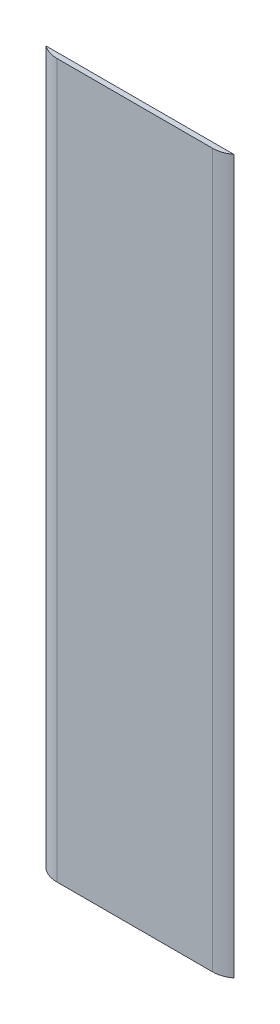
ISO-10303-21;
HEADER;
FILE_DESCRIPTION(('STEP AP214'),'2;1');
FILE_NAME('part.step','',(''),(''),'','','');
FILE_SCHEMA(('AUTOMOTIVE_DESIGN { 1 0 10303 214 1 1 1 1 }'));
ENDSEC;
DATA;
#1=APPLICATION_CONTEXT('core data for automotive mechanical design processes');
#2=APPLICATION_PROTOCOL_DEFINITION('international standard','automotive_design',2000,#1);
#3=PRODUCT_CONTEXT('',#1,'mechanical');
#4=PRODUCT('Part','Part','',(#3));
#5=PRODUCT_RELATED_PRODUCT_CATEGORY('part','',(#4));
#6=PRODUCT_DEFINITION_FORMATION('','',#4);
#7=PRODUCT_DEFINITION_CONTEXT('part definition',#1,'design');
#8=PRODUCT_DEFINITION('design','',#6,#7);
#9=PRODUCT_DEFINITION_SHAPE('','',#8);
#10=(LENGTH_UNIT() NAMED_UNIT(*) SI_UNIT(.MILLI.,.METRE.));
#11=(NAMED_UNIT(*) PLANE_ANGLE_UNIT() SI_UNIT($,.RADIAN.));
#12=(NAMED_UNIT(*) SI_UNIT($,.STERADIAN.) SOLID_ANGLE_UNIT());
#13=UNCERTAINTY_MEASURE_WITH_UNIT(LENGTH_MEASURE(1.E-05),#10,'distance_accuracy_value','');
#14=(GEOMETRIC_REPRESENTATION_CONTEXT(3) GLOBAL_UNCERTAINTY_ASSIGNED_CONTEXT((#13)) GLOBAL_UNIT_ASSIGNED_CONTEXT((#10,
#11,#12)) REPRESENTATION_CONTEXT('',''));
#15=CARTESIAN_POINT('',(0.,0.,0.));
#16=DIRECTION('',(0.,0.,1.));
#17=DIRECTION('',(1.,0.,0.));
#18=AXIS2_PLACEMENT_3D('',#15,#16,#17);
#19=CARTESIAN_POINT('',(0.,0.,0.));
#20=DIRECTION('',(0.,0.,-1.));
#21=DIRECTION('',(-1.,0.,0.));
#22=AXIS2_PLACEMENT_3D('',#19,#20,#21);
#23=PLANE('',#22);
#24=DIRECTION('',(0.,1.,0.));
#25=VECTOR('',#24,1.);
#26=CARTESIAN_POINT('',(17.5,-66.5,0.));
#27=LINE('',#26,#25);
#28=CARTESIAN_POINT('',(17.5,-66.5,0.));
#29=VERTEX_POINT('',#28);
#30=CARTESIAN_POINT('',(17.5,66.5,0.));
#31=VERTEX_POINT('',#30);
#32=EDGE_CURVE('E150',#29,#31,#27,.T.);
#33=ORIENTED_EDGE('',*,*,#32,.F.);
#34=DIRECTION('',(1.,0.,0.));
#35=VECTOR('',#34,1.);
#36=CARTESIAN_POINT('',(-17.5,-66.5,0.));
#37=LINE('',#36,#35);
#38=CARTESIAN_POINT('',(-17.5,-66.5,0.));
#39=VERTEX_POINT('',#38);
#40=EDGE_CURVE('E163',#39,#29,#37,.T.);
#41=ORIENTED_EDGE('',*,*,#40,.F.);
#42=DIRECTION('',(0.,-1.,0.));
#43=VECTOR('',#42,1.);
#44=CARTESIAN_POINT('',(-17.5,-66.5,0.));
#45=LINE('',#44,#43);
#46=CARTESIAN_POINT('',(-17.5,66.5,0.));
#47=VERTEX_POINT('',#46);
#48=EDGE_CURVE('E167',#47,#39,#45,.T.);
#49=ORIENTED_EDGE('',*,*,#48,.F.);
#50=DIRECTION('',(-1.,0.,0.));
#51=VECTOR('',#50,1.);
#52=CARTESIAN_POINT('',(-17.5,66.5,0.));
#53=LINE('',#52,#51);
#54=EDGE_CURVE('E153',#31,#47,#53,.T.);
#55=ORIENTED_EDGE('',*,*,#54,.F.);
#56=EDGE_LOOP('',(#33,#41,#49,#55));
#57=FACE_BOUND('',#56,.T.);
#58=DIRECTION('',(-1.,0.,0.));
#59=VECTOR('',#58,1.);
#60=CARTESIAN_POINT('',(15.,-26.,0.));
#61=LINE('',#60,#59);
#62=CARTESIAN_POINT('',(15.,-26.,0.));
#63=VERTEX_POINT('',#62);
#64=CARTESIAN_POINT('',(14.,-26.,0.));
#65=VERTEX_POINT('',#64);
#66=EDGE_CURVE('E353',#63,#65,#61,.T.);
#67=ORIENTED_EDGE('',*,*,#66,.F.);
#68=DIRECTION('',(0.,-1.,0.));
#69=VECTOR('',#68,1.);
#70=CARTESIAN_POINT('',(15.,64.,0.));
#71=LINE('',#70,#69);
#72=CARTESIAN_POINT('',(15.,64.,0.));
#73=VERTEX_POINT('',#72);
#74=EDGE_CURVE('E148',#73,#63,#71,.T.);
#75=ORIENTED_EDGE('',*,*,#74,.F.);
#76=DIRECTION('',(1.,0.,0.));
#77=VECTOR('',#76,1.);
#78=CARTESIAN_POINT('',(15.,64.,0.));
#79=LINE('',#78,#77);
#80=CARTESIAN_POINT('',(-15.,64.,0.));
#81=VERTEX_POINT('',#80);
#82=EDGE_CURVE('E144',#81,#73,#79,.T.);
#83=ORIENTED_EDGE('',*,*,#82,.F.);
#84=DIRECTION('',(0.,1.,0.));
#85=VECTOR('',#84,1.);
#86=CARTESIAN_POINT('',(-15.,64.,0.));
#87=LINE('',#86,#85);
#88=CARTESIAN_POINT('',(-15.,-26.,0.));
#89=VERTEX_POINT('',#88);
#90=EDGE_CURVE('E349',#89,#81,#87,.T.);
#91=ORIENTED_EDGE('',*,*,#90,.F.);
#92=DIRECTION('',(-1.,0.,0.));
#93=VECTOR('',#92,1.);
#94=CARTESIAN_POINT('',(-14.,-26.,0.));
#95=LINE('',#94,#93);
#96=CARTESIAN_POINT('',(-14.,-26.,0.));
#97=VERTEX_POINT('',#96);
#98=EDGE_CURVE('E365',#97,#89,#95,.T.);
#99=ORIENTED_EDGE('',*,*,#98,.F.);
#100=DIRECTION('',(0.,-1.,0.));
#101=VECTOR('',#100,1.);
#102=CARTESIAN_POINT('',(-14.,-25.,0.));
#103=LINE('',#102,#101);
#104=CARTESIAN_POINT('',(-14.,63.,0.));
#105=VERTEX_POINT('',#104);
#106=EDGE_CURVE('E363',#105,#97,#103,.T.);
#107=ORIENTED_EDGE('',*,*,#106,.F.);
#108=DIRECTION('',(-1.,0.,0.));
#109=VECTOR('',#108,1.);
#110=CARTESIAN_POINT('',(14.,63.,0.));
#111=LINE('',#110,#109);
#112=CARTESIAN_POINT('',(14.,63.,0.));
#113=VERTEX_POINT('',#112);
#114=EDGE_CURVE('E361',#113,#105,#111,.T.);
#115=ORIENTED_EDGE('',*,*,#114,.F.);
#116=DIRECTION('',(0.,1.,0.));
#117=VECTOR('',#116,1.);
#118=CARTESIAN_POINT('',(14.,63.,0.));
#119=LINE('',#118,#117);
#120=EDGE_CURVE('E355',#65,#113,#119,.T.);
#121=ORIENTED_EDGE('',*,*,#120,.F.);
#122=EDGE_LOOP('',(#67,#75,#83,#91,#99,#107,#115,#121));
#123=FACE_BOUND('',#122,.T.);
#124=ADVANCED_FACE('F36',(#57,#123),#23,.T.);
#125=CARTESIAN_POINT('',(-17.5,66.5,1.));
#126=DIRECTION('',(0.,-1.,0.));
#127=DIRECTION('',(0.,0.,-1.));
#128=AXIS2_PLACEMENT_3D('',#125,#126,#127);
#129=PLANE('',#128);
#130=ORIENTED_EDGE('',*,*,#54,.T.);
#131=CARTESIAN_POINT('',(-14.5,66.5,-4.));
#132=DIRECTION('',(0.,-1.,0.));
#133=DIRECTION('',(0.,0.,-1.));
#134=AXIS2_PLACEMENT_3D('',#131,#132,#133);
#135=CIRCLE('',#134,5.);
#136=CARTESIAN_POINT('',(-14.5,66.5,1.));
#137=VERTEX_POINT('',#136);
#138=EDGE_CURVE('E11',#47,#137,#135,.F.);
#139=ORIENTED_EDGE('',*,*,#138,.T.);
#140=DIRECTION('',(-1.,0.,0.));
#141=VECTOR('',#140,1.);
#142=CARTESIAN_POINT('',(-17.5,66.5,1.));
#143=LINE('',#142,#141);
#144=CARTESIAN_POINT('',(14.5,66.5,1.));
#145=VERTEX_POINT('',#144);
#146=EDGE_CURVE('E159',#145,#137,#143,.T.);
#147=ORIENTED_EDGE('',*,*,#146,.F.);
#148=CARTESIAN_POINT('',(14.5,66.5,-4.));
#149=DIRECTION('',(0.,-1.,0.));
#150=DIRECTION('',(0.,0.,-1.));
#151=AXIS2_PLACEMENT_3D('',#148,#149,#150);
#152=CIRCLE('',#151,5.);
#153=EDGE_CURVE('E44',#145,#31,#152,.F.);
#154=ORIENTED_EDGE('',*,*,#153,.T.);
#155=EDGE_LOOP('',(#130,#139,#147,#154));
#156=FACE_BOUND('',#155,.T.);
#157=ADVANCED_FACE('F181',(#156),#129,.F.);
#158=CARTESIAN_POINT('',(-17.5,-66.5,1.));
#159=DIRECTION('',(0.,1.,0.));
#160=DIRECTION('',(0.,0.,1.));
#161=AXIS2_PLACEMENT_3D('',#158,#159,#160);
#162=PLANE('',#161);
#163=DIRECTION('',(1.,0.,0.));
#164=VECTOR('',#163,1.);
#165=CARTESIAN_POINT('',(-17.5,-66.5,1.));
#166=LINE('',#165,#164);
#167=CARTESIAN_POINT('',(-14.5,-66.5,1.));
#168=VERTEX_POINT('',#167);
#169=CARTESIAN_POINT('',(14.5,-66.5,1.));
#170=VERTEX_POINT('',#169);
#171=EDGE_CURVE('E162',#168,#170,#166,.T.);
#172=ORIENTED_EDGE('',*,*,#171,.F.);
#173=CARTESIAN_POINT('',(-14.5,-66.5,-4.));
#174=DIRECTION('',(0.,1.,0.));
#175=DIRECTION('',(0.,0.,1.));
#176=AXIS2_PLACEMENT_3D('',#173,#174,#175);
#177=CIRCLE('',#176,5.);
#178=EDGE_CURVE('E177',#168,#39,#177,.F.);
#179=ORIENTED_EDGE('',*,*,#178,.T.);
#180=ORIENTED_EDGE('',*,*,#40,.T.);
#181=CARTESIAN_POINT('',(14.5,-66.5,-4.));
#182=DIRECTION('',(0.,1.,0.));
#183=DIRECTION('',(0.,0.,1.));
#184=AXIS2_PLACEMENT_3D('',#181,#182,#183);
#185=CIRCLE('',#184,5.);
#186=EDGE_CURVE('E59',#29,#170,#185,.F.);
#187=ORIENTED_EDGE('',*,*,#186,.T.);
#188=EDGE_LOOP('',(#172,#179,#180,#187));
#189=FACE_BOUND('',#188,.T.);
#190=ADVANCED_FACE('F193',(#189),#162,.F.);
#191=CARTESIAN_POINT('',(0.,0.,1.));
#192=DIRECTION('',(0.,0.,-1.));
#193=DIRECTION('',(-1.,0.,0.));
#194=AXIS2_PLACEMENT_3D('',#191,#192,#193);
#195=PLANE('',#194);
#196=ORIENTED_EDGE('',*,*,#146,.T.);
#197=DIRECTION('',(0.,1.,0.));
#198=VECTOR('',#197,1.);
#199=CARTESIAN_POINT('',(-14.5,0.,1.));
#200=LINE('',#199,#198);
#201=EDGE_CURVE('E173',#137,#168,#200,.F.);
#202=ORIENTED_EDGE('',*,*,#201,.T.);
#203=ORIENTED_EDGE('',*,*,#171,.T.);
#204=DIRECTION('',(0.,-1.,0.));
#205=VECTOR('',#204,1.);
#206=CARTESIAN_POINT('',(14.5,0.,1.));
#207=LINE('',#206,#205);
#208=EDGE_CURVE('E164',#170,#145,#207,.F.);
#209=ORIENTED_EDGE('',*,*,#208,.T.);
#210=EDGE_LOOP('',(#196,#202,#203,#209));
#211=FACE_BOUND('',#210,.T.);
#212=ADVANCED_FACE('F191',(#211),#195,.F.);
#213=CARTESIAN_POINT('',(-14.5,-66.5,-4.));
#214=DIRECTION('',(0.,1.,0.));
#215=DIRECTION('',(0.,0.,1.));
#216=AXIS2_PLACEMENT_3D('',#213,#214,#215);
#217=CYLINDRICAL_SURFACE('',#216,5.);
#218=ORIENTED_EDGE('',*,*,#138,.F.);
#219=ORIENTED_EDGE('',*,*,#48,.T.);
#220=ORIENTED_EDGE('',*,*,#178,.F.);
#221=ORIENTED_EDGE('',*,*,#201,.F.);
#222=EDGE_LOOP('',(#218,#219,#220,#221));
#223=FACE_BOUND('',#222,.T.);
#224=ADVANCED_FACE('F195',(#223),#217,.T.);
#225=CARTESIAN_POINT('',(14.5,-66.5,-4.));
#226=DIRECTION('',(0.,-1.,0.));
#227=DIRECTION('',(0.,0.,-1.));
#228=AXIS2_PLACEMENT_3D('',#225,#226,#227);
#229=CYLINDRICAL_SURFACE('',#228,5.);
#230=ORIENTED_EDGE('',*,*,#186,.F.);
#231=ORIENTED_EDGE('',*,*,#32,.T.);
#232=ORIENTED_EDGE('',*,*,#153,.F.);
#233=ORIENTED_EDGE('',*,*,#208,.F.);
#234=EDGE_LOOP('',(#230,#231,#232,#233));
#235=FACE_BOUND('',#234,.T.);
#236=ADVANCED_FACE('F38',(#235),#229,.T.);
#237=CARTESIAN_POINT('',(15.,64.,-2.));
#238=DIRECTION('',(-1.,0.,0.));
#239=DIRECTION('',(0.,-1.,0.));
#240=AXIS2_PLACEMENT_3D('',#237,#238,#239);
#241=PLANE('',#240);
#242=ORIENTED_EDGE('',*,*,#74,.T.);
#243=DIRECTION('',(0.,0.,1.));
#244=VECTOR('',#243,1.);
#245=CARTESIAN_POINT('',(15.,-26.,-2.));
#246=LINE('',#245,#244);
#247=CARTESIAN_POINT('',(15.,-26.,-2.));
#248=VERTEX_POINT('',#247);
#249=EDGE_CURVE('E129',#248,#63,#246,.T.);
#250=ORIENTED_EDGE('',*,*,#249,.F.);
#251=DIRECTION('',(0.,-1.,0.));
#252=VECTOR('',#251,1.);
#253=CARTESIAN_POINT('',(15.,64.,-2.));
#254=LINE('',#253,#252);
#255=CARTESIAN_POINT('',(15.,64.,-2.));
#256=VERTEX_POINT('',#255);
#257=EDGE_CURVE('E136',#256,#248,#254,.T.);
#258=ORIENTED_EDGE('',*,*,#257,.F.);
#259=DIRECTION('',(0.,0.,1.));
#260=VECTOR('',#259,1.);
#261=CARTESIAN_POINT('',(15.,64.,-2.));
#262=LINE('',#261,#260);
#263=EDGE_CURVE('E347',#256,#73,#262,.T.);
#264=ORIENTED_EDGE('',*,*,#263,.T.);
#265=EDGE_LOOP('',(#242,#250,#258,#264));
#266=FACE_BOUND('',#265,.T.);
#267=ADVANCED_FACE('F146',(#266),#241,.F.);
#268=CARTESIAN_POINT('',(15.,-26.,-2.));
#269=DIRECTION('',(0.,1.,0.));
#270=DIRECTION('',(0.,0.,1.));
#271=AXIS2_PLACEMENT_3D('',#268,#269,#270);
#272=PLANE('',#271);
#273=ORIENTED_EDGE('',*,*,#66,.T.);
#274=DIRECTION('',(0.,0.,1.));
#275=VECTOR('',#274,1.);
#276=CARTESIAN_POINT('',(14.,-26.,-2.));
#277=LINE('',#276,#275);
#278=CARTESIAN_POINT('',(14.,-26.,-2.));
#279=VERTEX_POINT('',#278);
#280=EDGE_CURVE('E132',#279,#65,#277,.T.);
#281=ORIENTED_EDGE('',*,*,#280,.F.);
#282=DIRECTION('',(-1.,0.,0.));
#283=VECTOR('',#282,1.);
#284=CARTESIAN_POINT('',(15.,-26.,-2.));
#285=LINE('',#284,#283);
#286=EDGE_CURVE('E125',#248,#279,#285,.T.);
#287=ORIENTED_EDGE('',*,*,#286,.F.);
#288=ORIENTED_EDGE('',*,*,#249,.T.);
#289=EDGE_LOOP('',(#273,#281,#287,#288));
#290=FACE_BOUND('',#289,.T.);
#291=ADVANCED_FACE('F127',(#290),#272,.F.);
#292=CARTESIAN_POINT('',(14.,63.,-2.));
#293=DIRECTION('',(1.,0.,0.));
#294=DIRECTION('',(0.,0.,-1.));
#295=AXIS2_PLACEMENT_3D('',#292,#293,#294);
#296=PLANE('',#295);
#297=ORIENTED_EDGE('',*,*,#120,.T.);
#298=DIRECTION('',(0.,0.,1.));
#299=VECTOR('',#298,1.);
#300=CARTESIAN_POINT('',(14.,63.,-2.));
#301=LINE('',#300,#299);
#302=CARTESIAN_POINT('',(14.,63.,-2.));
#303=VERTEX_POINT('',#302);
#304=EDGE_CURVE('E155',#303,#113,#301,.T.);
#305=ORIENTED_EDGE('',*,*,#304,.F.);
#306=DIRECTION('',(0.,1.,0.));
#307=VECTOR('',#306,1.);
#308=CARTESIAN_POINT('',(14.,-25.,-2.));
#309=LINE('',#308,#307);
#310=EDGE_CURVE('E135',#279,#303,#309,.T.);
#311=ORIENTED_EDGE('',*,*,#310,.F.);
#312=ORIENTED_EDGE('',*,*,#280,.T.);
#313=EDGE_LOOP('',(#297,#305,#311,#312));
#314=FACE_BOUND('',#313,.T.);
#315=ADVANCED_FACE('F253',(#314),#296,.F.);
#316=CARTESIAN_POINT('',(14.,63.,-2.));
#317=DIRECTION('',(0.,1.,0.));
#318=DIRECTION('',(0.,0.,1.));
#319=AXIS2_PLACEMENT_3D('',#316,#317,#318);
#320=PLANE('',#319);
#321=ORIENTED_EDGE('',*,*,#114,.T.);
#322=DIRECTION('',(0.,0.,1.));
#323=VECTOR('',#322,1.);
#324=CARTESIAN_POINT('',(-14.,63.,-2.));
#325=LINE('',#324,#323);
#326=CARTESIAN_POINT('',(-14.,63.,-2.));
#327=VERTEX_POINT('',#326);
#328=EDGE_CURVE('E375',#327,#105,#325,.T.);
#329=ORIENTED_EDGE('',*,*,#328,.F.);
#330=DIRECTION('',(-1.,0.,0.));
#331=VECTOR('',#330,1.);
#332=CARTESIAN_POINT('',(14.,63.,-2.));
#333=LINE('',#332,#331);
#334=EDGE_CURVE('E382',#303,#327,#333,.T.);
#335=ORIENTED_EDGE('',*,*,#334,.F.);
#336=ORIENTED_EDGE('',*,*,#304,.T.);
#337=EDGE_LOOP('',(#321,#329,#335,#336));
#338=FACE_BOUND('',#337,.T.);
#339=ADVANCED_FACE('F264',(#338),#320,.F.);
#340=CARTESIAN_POINT('',(-14.,-25.,-2.));
#341=DIRECTION('',(-1.,0.,0.));
#342=DIRECTION('',(0.,0.,1.));
#343=AXIS2_PLACEMENT_3D('',#340,#341,#342);
#344=PLANE('',#343);
#345=ORIENTED_EDGE('',*,*,#106,.T.);
#346=DIRECTION('',(0.,0.,1.));
#347=VECTOR('',#346,1.);
#348=CARTESIAN_POINT('',(-14.,-26.,-2.));
#349=LINE('',#348,#347);
#350=CARTESIAN_POINT('',(-14.,-26.,-2.));
#351=VERTEX_POINT('',#350);
#352=EDGE_CURVE('E372',#351,#97,#349,.T.);
#353=ORIENTED_EDGE('',*,*,#352,.F.);
#354=DIRECTION('',(0.,-1.,0.));
#355=VECTOR('',#354,1.);
#356=CARTESIAN_POINT('',(-14.,63.,-2.));
#357=LINE('',#356,#355);
#358=EDGE_CURVE('E392',#327,#351,#357,.T.);
#359=ORIENTED_EDGE('',*,*,#358,.F.);
#360=ORIENTED_EDGE('',*,*,#328,.T.);
#361=EDGE_LOOP('',(#345,#353,#359,#360));
#362=FACE_BOUND('',#361,.T.);
#363=ADVANCED_FACE('F274',(#362),#344,.F.);
#364=CARTESIAN_POINT('',(-14.,-26.,-2.));
#365=DIRECTION('',(0.,1.,0.));
#366=DIRECTION('',(0.,0.,1.));
#367=AXIS2_PLACEMENT_3D('',#364,#365,#366);
#368=PLANE('',#367);
#369=ORIENTED_EDGE('',*,*,#98,.T.);
#370=DIRECTION('',(0.,0.,1.));
#371=VECTOR('',#370,1.);
#372=CARTESIAN_POINT('',(-15.,-26.,-2.));
#373=LINE('',#372,#371);
#374=CARTESIAN_POINT('',(-15.,-26.,-2.));
#375=VERTEX_POINT('',#374);
#376=EDGE_CURVE('E369',#375,#89,#373,.T.);
#377=ORIENTED_EDGE('',*,*,#376,.F.);
#378=DIRECTION('',(-1.,0.,0.));
#379=VECTOR('',#378,1.);
#380=CARTESIAN_POINT('',(-14.,-26.,-2.));
#381=LINE('',#380,#379);
#382=EDGE_CURVE('E389',#351,#375,#381,.T.);
#383=ORIENTED_EDGE('',*,*,#382,.F.);
#384=ORIENTED_EDGE('',*,*,#352,.T.);
#385=EDGE_LOOP('',(#369,#377,#383,#384));
#386=FACE_BOUND('',#385,.T.);
#387=ADVANCED_FACE('F286',(#386),#368,.F.);
#388=CARTESIAN_POINT('',(-15.,64.,-2.));
#389=DIRECTION('',(1.,0.,0.));
#390=DIRECTION('',(0.,1.,0.));
#391=AXIS2_PLACEMENT_3D('',#388,#389,#390);
#392=PLANE('',#391);
#393=ORIENTED_EDGE('',*,*,#90,.T.);
#394=DIRECTION('',(0.,0.,1.));
#395=VECTOR('',#394,1.);
#396=CARTESIAN_POINT('',(-15.,64.,-2.));
#397=LINE('',#396,#395);
#398=CARTESIAN_POINT('',(-15.,64.,-2.));
#399=VERTEX_POINT('',#398);
#400=EDGE_CURVE('E51',#399,#81,#397,.T.);
#401=ORIENTED_EDGE('',*,*,#400,.F.);
#402=DIRECTION('',(0.,1.,0.));
#403=VECTOR('',#402,1.);
#404=CARTESIAN_POINT('',(-15.,64.,-2.));
#405=LINE('',#404,#403);
#406=EDGE_CURVE('E391',#375,#399,#405,.T.);
#407=ORIENTED_EDGE('',*,*,#406,.F.);
#408=ORIENTED_EDGE('',*,*,#376,.T.);
#409=EDGE_LOOP('',(#393,#401,#407,#408));
#410=FACE_BOUND('',#409,.T.);
#411=ADVANCED_FACE('F296',(#410),#392,.F.);
#412=CARTESIAN_POINT('',(15.,64.,-2.));
#413=DIRECTION('',(0.,-1.,0.));
#414=DIRECTION('',(0.,0.,-1.));
#415=AXIS2_PLACEMENT_3D('',#412,#413,#414);
#416=PLANE('',#415);
#417=ORIENTED_EDGE('',*,*,#82,.T.);
#418=ORIENTED_EDGE('',*,*,#263,.F.);
#419=DIRECTION('',(1.,0.,0.));
#420=VECTOR('',#419,1.);
#421=CARTESIAN_POINT('',(15.,64.,-2.));
#422=LINE('',#421,#420);
#423=EDGE_CURVE('E140',#399,#256,#422,.T.);
#424=ORIENTED_EDGE('',*,*,#423,.F.);
#425=ORIENTED_EDGE('',*,*,#400,.T.);
#426=EDGE_LOOP('',(#417,#418,#424,#425));
#427=FACE_BOUND('',#426,.T.);
#428=ADVANCED_FACE('F307',(#427),#416,.F.);
#429=CARTESIAN_POINT('',(0.,0.,-2.));
#430=DIRECTION('',(0.,0.,-1.));
#431=DIRECTION('',(-1.,0.,0.));
#432=AXIS2_PLACEMENT_3D('',#429,#430,#431);
#433=PLANE('',#432);
#434=ORIENTED_EDGE('',*,*,#257,.T.);
#435=ORIENTED_EDGE('',*,*,#286,.T.);
#436=ORIENTED_EDGE('',*,*,#310,.T.);
#437=ORIENTED_EDGE('',*,*,#334,.T.);
#438=ORIENTED_EDGE('',*,*,#358,.T.);
#439=ORIENTED_EDGE('',*,*,#382,.T.);
#440=ORIENTED_EDGE('',*,*,#406,.T.);
#441=ORIENTED_EDGE('',*,*,#423,.T.);
#442=EDGE_LOOP('',(#434,#435,#436,#437,#438,#439,#440,#441));
#443=FACE_BOUND('',#442,.T.);
#444=ADVANCED_FACE('F139',(#443),#433,.T.);
#445=CLOSED_SHELL('',(#124,#157,#190,#212,#224,#236,#267,#291,#315,#339,#363,#387,#411,#428,#444));
#446=MANIFOLD_SOLID_BREP('B2',#445);
#447=ADVANCED_BREP_SHAPE_REPRESENTATION('',(#18,#446),#14);
#448=SHAPE_DEFINITION_REPRESENTATION(#9,#447);
ENDSEC;
END-ISO-10303-21;
